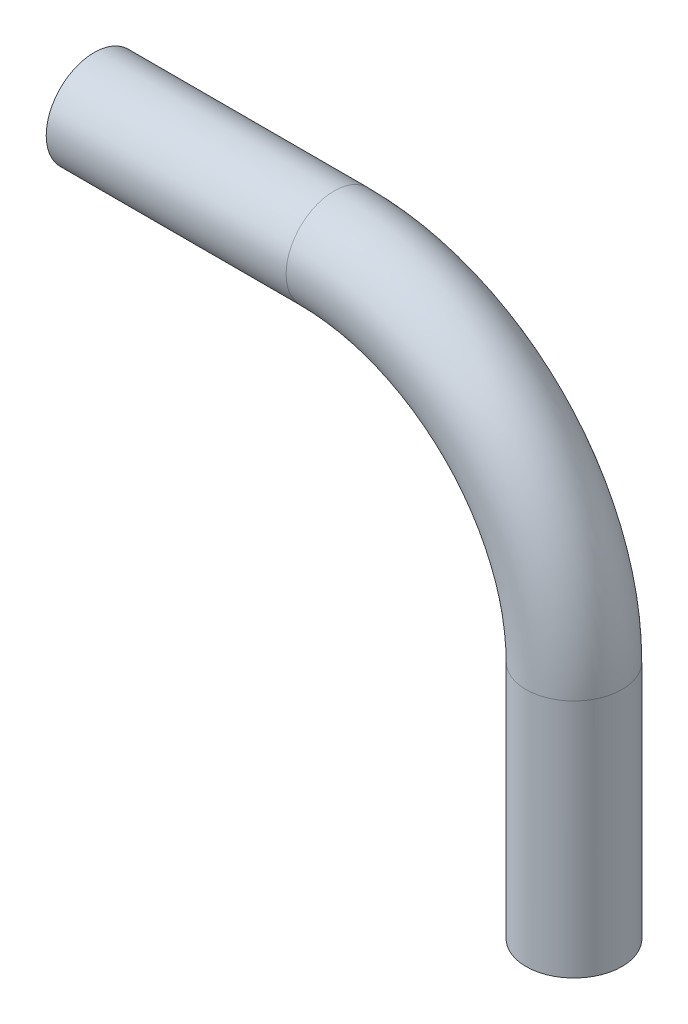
from build123d import *

# Parameters (mm, degrees)
SKETCH2_R   = 4.7625
SKETCH2_R_2 = 3.8735


with BuildPart() as part:
    # Sweep1: sweep along a path in Sketch1
    with BuildLine(Plane.XY) as sweep1_path:
        Line((0, 0), (0, 23.8125))
        ThreePointArc((0, 23.8125), (-6.974519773, 40.650480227), (-23.8125, 47.625))
        Line((-23.8125, 47.625), (-47.625, 47.625))
    # Sketch2 → Sweep1 (sweep)
    with BuildSketch(Plane(origin=(0, 0, 0), x_dir=(1, 0, 0), z_dir=(0, 1, 0))):
        Circle(SKETCH2_R)
        Circle(SKETCH2_R_2, mode=Mode.SUBTRACT)
    sweep(path=sweep1_path.line)


solid = part.part
